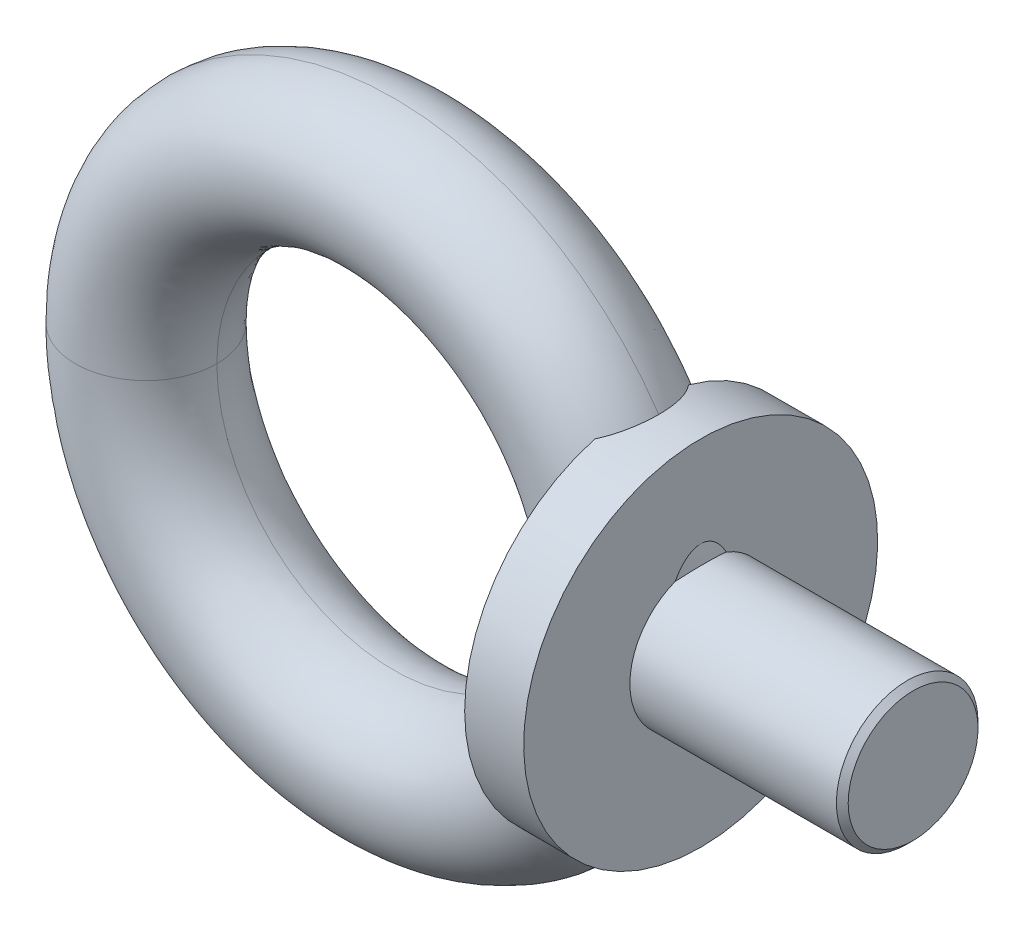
ISO-10303-21;
HEADER;
FILE_DESCRIPTION(('STEP AP214'),'2;1');
FILE_NAME('part.step','',(''),(''),'','','');
FILE_SCHEMA(('AUTOMOTIVE_DESIGN { 1 0 10303 214 1 1 1 1 }'));
ENDSEC;
DATA;
#1=APPLICATION_CONTEXT('core data for automotive mechanical design processes');
#2=APPLICATION_PROTOCOL_DEFINITION('international standard','automotive_design',2000,#1);
#3=PRODUCT_CONTEXT('',#1,'mechanical');
#4=PRODUCT('Part','Part','',(#3));
#5=PRODUCT_RELATED_PRODUCT_CATEGORY('part','',(#4));
#6=PRODUCT_DEFINITION_FORMATION('','',#4);
#7=PRODUCT_DEFINITION_CONTEXT('part definition',#1,'design');
#8=PRODUCT_DEFINITION('design','',#6,#7);
#9=PRODUCT_DEFINITION_SHAPE('','',#8);
#10=(LENGTH_UNIT() NAMED_UNIT(*) SI_UNIT(.MILLI.,.METRE.));
#11=(NAMED_UNIT(*) PLANE_ANGLE_UNIT() SI_UNIT($,.RADIAN.));
#12=(NAMED_UNIT(*) SI_UNIT($,.STERADIAN.) SOLID_ANGLE_UNIT());
#13=UNCERTAINTY_MEASURE_WITH_UNIT(LENGTH_MEASURE(1.E-05),#10,'distance_accuracy_value','');
#14=(GEOMETRIC_REPRESENTATION_CONTEXT(3) GLOBAL_UNCERTAINTY_ASSIGNED_CONTEXT((#13)) GLOBAL_UNIT_ASSIGNED_CONTEXT((#10,
#11,#12)) REPRESENTATION_CONTEXT('',''));
#15=CARTESIAN_POINT('',(0.,0.,0.));
#16=DIRECTION('',(0.,0.,1.));
#17=DIRECTION('',(1.,0.,0.));
#18=AXIS2_PLACEMENT_3D('',#15,#16,#17);
#19=CARTESIAN_POINT('',(-130.,-34.566,59.434));
#20=DIRECTION('',(1.,0.,0.));
#21=DIRECTION('',(0.,1.,0.));
#22=AXIS2_PLACEMENT_3D('',#19,#20,#21);
#23=PLANE('',#22);
#24=CARTESIAN_POINT('',(-130.,-29.,65.));
#25=DIRECTION('',(-1.,0.,0.));
#26=DIRECTION('',(0.,0.,1.));
#27=AXIS2_PLACEMENT_3D('',#24,#25,#26);
#28=CIRCLE('',#27,5.5);
#29=CARTESIAN_POINT('',(-130.,-29.,70.5));
#30=VERTEX_POINT('',#29);
#31=EDGE_CURVE('E29',#30,#30,#28,.F.);
#32=ORIENTED_EDGE('',*,*,#31,.T.);
#33=EDGE_LOOP('',(#32));
#34=FACE_BOUND('',#33,.T.);
#35=ADVANCED_FACE('F24',(#34),#23,.T.);
#36=CARTESIAN_POINT('',(-130.,-29.,65.));
#37=DIRECTION('',(-1.,0.,0.));
#38=DIRECTION('',(0.,0.,1.));
#39=AXIS2_PLACEMENT_3D('',#36,#37,#38);
#40=CONICAL_SURFACE('',#39,5.5,0.785398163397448);
#41=CARTESIAN_POINT('',(-130.5,-29.,65.));
#42=DIRECTION('',(1.,0.,0.));
#43=DIRECTION('',(0.,0.,-1.));
#44=AXIS2_PLACEMENT_3D('',#41,#42,#43);
#45=CIRCLE('',#44,6.);
#46=CARTESIAN_POINT('',(-130.5,-29.,59.));
#47=VERTEX_POINT('',#46);
#48=EDGE_CURVE('E100',#47,#47,#45,.T.);
#49=ORIENTED_EDGE('',*,*,#48,.T.);
#50=EDGE_LOOP('',(#49));
#51=FACE_BOUND('',#50,.T.);
#52=ORIENTED_EDGE('',*,*,#31,.F.);
#53=EDGE_LOOP('',(#52));
#54=FACE_BOUND('',#53,.T.);
#55=ADVANCED_FACE('F358',(#51,#54),#40,.T.);
#56=CARTESIAN_POINT('',(-148.640821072,-21.883061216,62.262132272));
#57=CARTESIAN_POINT('',(-148.493699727,-22.407286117,62.262132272));
#58=CARTESIAN_POINT('',(-148.362899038,-22.935819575,62.262132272));
#59=CARTESIAN_POINT('',(-148.248544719,-23.468153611,62.262132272));
#60=CARTESIAN_POINT('',(-147.775350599,-21.640170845,64.015028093));
#61=CARTESIAN_POINT('',(-147.623208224,-22.18228675,64.015028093));
#62=CARTESIAN_POINT('',(-147.487943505,-22.728858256,64.015028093));
#63=CARTESIAN_POINT('',(-147.369686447,-23.27936005,64.015028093));
#64=CARTESIAN_POINT('',(-147.775350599,-21.640170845,65.984971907));
#65=CARTESIAN_POINT('',(-147.623208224,-22.18228675,65.984971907));
#66=CARTESIAN_POINT('',(-147.487943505,-22.728858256,65.984971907));
#67=CARTESIAN_POINT('',(-147.369686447,-23.27936005,65.984971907));
#68=CARTESIAN_POINT('',(-148.640821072,-21.883061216,67.737867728));
#69=CARTESIAN_POINT('',(-148.493699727,-22.407286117,67.737867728));
#70=CARTESIAN_POINT('',(-148.362899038,-22.935819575,67.737867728));
#71=CARTESIAN_POINT('',(-148.248544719,-23.468153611,67.737867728));
#72=(BOUNDED_SURFACE() B_SPLINE_SURFACE(3,3,((#56,#57,#58,#59),(#60,#61,#62,#63),(#64,#65,#66,
#67),(#68,#69,#70,#71)),.UNSPECIFIED.,.F.,.F.,.F.) B_SPLINE_SURFACE_WITH_KNOTS((4,4),(4,4),(0.,
1.),(0.,1.),.UNSPECIFIED.) GEOMETRIC_REPRESENTATION_ITEM() RATIONAL_B_SPLINE_SURFACE(((1.,
0.999679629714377,0.999679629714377,1.),(0.926546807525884,0.926249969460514,0.926249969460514,
0.926546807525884),(0.926546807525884,0.926249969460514,0.926249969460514,0.926546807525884),
(1.,0.999679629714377,0.999679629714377,1.))) REPRESENTATION_ITEM('') SURFACE());
#73=CARTESIAN_POINT('',(-148.,-23.4047619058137,67.1664050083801));
#74=CARTESIAN_POINT('',(-148.,-23.3461375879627,67.1345465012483));
#75=CARTESIAN_POINT('',(-148.,-23.2880537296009,67.101703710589));
#76=CARTESIAN_POINT('',(-148.,-23.1731217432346,67.0338865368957));
#77=CARTESIAN_POINT('',(-148.,-23.1162739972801,66.998911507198));
#78=CARTESIAN_POINT('',(-148.,-22.9461304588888,66.8894539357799));
#79=CARTESIAN_POINT('',(-148.,-22.8350635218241,66.81141616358));
#80=CARTESIAN_POINT('',(-148.,-22.6558675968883,66.6716846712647));
#81=CARTESIAN_POINT('',(-148.,-22.5854867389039,66.612888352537));
#82=CARTESIAN_POINT('',(-148.,-22.4495110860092,66.4900062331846));
#83=CARTESIAN_POINT('',(-148.,-22.3839181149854,66.4259184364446));
#84=CARTESIAN_POINT('',(-148.,-22.1970067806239,66.225907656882));
#85=CARTESIAN_POINT('',(-148.000000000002,-22.0842982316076,66.0813025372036));
#86=CARTESIAN_POINT('',(-148.000000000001,-21.9387847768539,65.8385627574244));
#87=CARTESIAN_POINT('',(-148.,-21.892741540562,65.748382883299));
#88=CARTESIAN_POINT('',(-148.,-21.8347632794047,65.6085233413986));
#89=CARTESIAN_POINT('',(-148.,-21.817281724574,65.5611250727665));
#90=CARTESIAN_POINT('',(-148.,-21.7863738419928,65.4650333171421));
#91=CARTESIAN_POINT('',(-148.,-21.7729458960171,65.4163403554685));
#92=CARTESIAN_POINT('',(-148.,-21.750363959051,65.3175499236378));
#93=CARTESIAN_POINT('',(-148.,-21.7412457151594,65.2674442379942));
#94=CARTESIAN_POINT('',(-148.,-21.7276869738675,65.1666235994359));
#95=CARTESIAN_POINT('',(-148.,-21.7232443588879,65.1159089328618));
#96=CARTESIAN_POINT('',(-148.,-21.7191555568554,65.0142858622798));
#97=CARTESIAN_POINT('',(-148.,-21.7195090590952,64.9633774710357));
#98=CARTESIAN_POINT('',(-148.,-21.7249932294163,64.8618332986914));
#99=CARTESIAN_POINT('',(-148.,-21.7301237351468,64.8111975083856));
#100=CARTESIAN_POINT('',(-148.,-21.7510861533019,64.6699007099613));
#101=CARTESIAN_POINT('',(-148.,-21.7722166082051,64.5799806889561));
#102=CARTESIAN_POINT('',(-148.,-21.8280248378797,64.4045315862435));
#103=CARTESIAN_POINT('',(-148.,-21.8627111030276,64.3190052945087));
#104=CARTESIAN_POINT('',(-148.,-21.9612763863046,64.1167809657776));
#105=CARTESIAN_POINT('',(-148.,-22.031279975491,64.0030776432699));
#106=CARTESIAN_POINT('',(-148.,-22.1883800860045,63.7880971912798));
#107=CARTESIAN_POINT('',(-148.,-22.2755212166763,63.6868536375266));
#108=CARTESIAN_POINT('',(-148.,-22.4057231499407,63.5536079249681));
#109=CARTESIAN_POINT('',(-148.,-22.443796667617,63.5165645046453));
#110=CARTESIAN_POINT('',(-148.,-22.521567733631,63.4443347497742));
#111=CARTESIAN_POINT('',(-148.,-22.5612627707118,63.4091457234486));
#112=CARTESIAN_POINT('',(-148.,-22.6824982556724,63.3061862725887));
#113=CARTESIAN_POINT('',(-148.,-22.7662274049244,63.2409848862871));
#114=CARTESIAN_POINT('',(-148.,-22.9403278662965,63.1152188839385));
#115=CARTESIAN_POINT('',(-148.,-23.0308141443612,63.0548150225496));
#116=CARTESIAN_POINT('',(-148.,-23.1692115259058,62.9686419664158));
#117=CARTESIAN_POINT('',(-148.,-23.2157684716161,62.9406672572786));
#118=CARTESIAN_POINT('',(-148.,-23.3096853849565,62.8861085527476));
#119=CARTESIAN_POINT('',(-148.,-23.3570452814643,62.8595244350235));
#120=CARTESIAN_POINT('',(-148.,-23.404761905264,62.8335949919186));
#121=B_SPLINE_CURVE_WITH_KNOTS('',3,(#73,#74,#75,#76,#77,#78,#79,#80,#81,#82,#83,#84,#85,#86,
#87,#88,#89,#90,#91,#92,#93,#94,#95,#96,#97,#98,#99,#100,#101,#102,#103,#104,#105,#106,#107,
#108,#109,#110,#111,#112,#113,#114,#115,#116,#117,#118,#119,#120),.UNSPECIFIED.,.F.,.F.,(4,2,2,
2,2,2,2,2,2,2,2,2,2,2,2,2,2,2,2,2,2,2,2,4),(0.,0.200141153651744,0.400343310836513,
0.806953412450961,1.08181256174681,1.3567758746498,1.90205105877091,2.20468732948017,
2.35608753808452,2.50742722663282,2.66000108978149,2.81250582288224,2.96500067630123,
3.11749034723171,3.39327580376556,3.66923426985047,4.06756194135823,4.46694052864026,
4.62626560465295,4.78535265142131,5.10336416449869,5.42948975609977,5.59241532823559,
5.75532654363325),.UNSPECIFIED.);
#122=CARTESIAN_POINT('',(-148.000000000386,-23.4047619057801,67.1664050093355));
#123=VERTEX_POINT('',#122);
#124=CARTESIAN_POINT('',(-148.000000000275,-23.4047619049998,62.8335949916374));
#125=VERTEX_POINT('',#124);
#126=EDGE_CURVE('E96',#123,#125,#121,.T.);
#127=CARTESIAN_POINT('',(-148.000000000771,-23.4047619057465,67.166405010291));
#128=CARTESIAN_POINT('',(-147.973457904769,-23.371899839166,67.0815426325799));
#129=CARTESIAN_POINT('',(-147.948393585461,-23.3408178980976,66.995521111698));
#130=CARTESIAN_POINT('',(-147.901332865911,-23.2823841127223,66.8213450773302));
#131=CARTESIAN_POINT('',(-147.879338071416,-23.2550342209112,66.7331894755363));
#132=CARTESIAN_POINT('',(-147.838553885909,-23.2042655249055,66.5550072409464));
#133=CARTESIAN_POINT('',(-147.819764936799,-23.180847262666,66.464980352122));
#134=CARTESIAN_POINT('',(-147.785533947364,-23.1381443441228,66.2834815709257));
#135=CARTESIAN_POINT('',(-147.770086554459,-23.1188530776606,66.1920122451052));
#136=CARTESIAN_POINT('',(-147.742597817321,-23.0845004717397,66.0077905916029));
#137=CARTESIAN_POINT('',(-147.730555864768,-23.06943837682,65.9150384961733));
#138=CARTESIAN_POINT('',(-147.709951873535,-23.0436541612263,65.7285645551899));
#139=CARTESIAN_POINT('',(-147.701389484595,-23.0329316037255,65.6348428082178));
#140=CARTESIAN_POINT('',(-147.684638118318,-23.0119484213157,65.4029565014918));
#141=CARTESIAN_POINT('',(-147.678476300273,-23.004223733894,65.2644018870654));
#142=CARTESIAN_POINT('',(-147.673837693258,-22.9984091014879,64.9869566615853));
#143=CARTESIAN_POINT('',(-147.675361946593,-23.0003204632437,64.8480660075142));
#144=CARTESIAN_POINT('',(-147.68607181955,-23.0137431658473,64.5711333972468));
#145=CARTESIAN_POINT('',(-147.695252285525,-23.0252480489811,64.4330909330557));
#146=CARTESIAN_POINT('',(-147.72112787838,-23.0576439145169,64.1588834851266));
#147=CARTESIAN_POINT('',(-147.737821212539,-23.0785326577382,64.0227180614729));
#148=CARTESIAN_POINT('',(-147.785697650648,-23.1383600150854,63.7055652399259));
#149=CARTESIAN_POINT('',(-147.819915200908,-23.1810669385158,63.52571738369));
#150=CARTESIAN_POINT('',(-147.880608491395,-23.256614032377,63.2616325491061));
#151=CARTESIAN_POINT('',(-147.902391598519,-23.2836994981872,63.1745812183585));
#152=CARTESIAN_POINT('',(-147.948967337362,-23.3415294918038,63.0025161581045));
#153=CARTESIAN_POINT('',(-147.973760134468,-23.3722742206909,62.9175025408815));
#154=CARTESIAN_POINT('',(-148.000000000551,-23.4047619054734,62.8335949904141));
#155=B_SPLINE_CURVE_WITH_KNOTS('',3,(#127,#128,#129,#130,#131,#132,#133,#134,#135,#136,#137,
#138,#139,#140,#141,#142,#143,#144,#145,#146,#147,#148,#149,#150,#151,#152,#153,#154),
.UNSPECIFIED.,.F.,.F.,(4,2,2,2,2,2,2,2,2,2,2,2,2,4),(0.,0.284358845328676,0.56886589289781,
0.853412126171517,1.13749913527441,1.42153536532,1.70554299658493,2.12168639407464,
2.53788622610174,2.9538061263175,3.36962683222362,3.93218572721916,4.21327082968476,
4.49437138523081),.UNSPECIFIED.);
#156=EDGE_CURVE('E91',#123,#125,#155,.T.);
#157=ORIENTED_EDGE('',*,*,#126,.F.);
#158=ORIENTED_EDGE('',*,*,#156,.T.);
#159=EDGE_LOOP('',(#157,#158));
#160=FACE_BOUND('',#159,.T.);
#161=ADVANCED_FACE('F99',(#160),#72,.T.);
#162=CARTESIAN_POINT('',(-148.248544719,-34.531846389,62.262132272));
#163=CARTESIAN_POINT('',(-148.362899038,-35.064180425,62.262132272));
#164=CARTESIAN_POINT('',(-148.493699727,-35.592713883,62.262132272));
#165=CARTESIAN_POINT('',(-148.640821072,-36.116938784,62.262132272));
#166=CARTESIAN_POINT('',(-147.369686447,-34.72063995,64.015028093));
#167=CARTESIAN_POINT('',(-147.487943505,-35.271141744,64.015028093));
#168=CARTESIAN_POINT('',(-147.623208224,-35.81771325,64.015028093));
#169=CARTESIAN_POINT('',(-147.775350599,-36.359829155,64.015028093));
#170=CARTESIAN_POINT('',(-147.369686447,-34.72063995,65.984971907));
#171=CARTESIAN_POINT('',(-147.487943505,-35.271141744,65.984971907));
#172=CARTESIAN_POINT('',(-147.623208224,-35.81771325,65.984971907));
#173=CARTESIAN_POINT('',(-147.775350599,-36.359829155,65.984971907));
#174=CARTESIAN_POINT('',(-148.248544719,-34.531846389,67.737867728));
#175=CARTESIAN_POINT('',(-148.362899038,-35.064180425,67.737867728));
#176=CARTESIAN_POINT('',(-148.493699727,-35.592713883,67.737867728));
#177=CARTESIAN_POINT('',(-148.640821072,-36.116938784,67.737867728));
#178=(BOUNDED_SURFACE() B_SPLINE_SURFACE(3,3,((#162,#163,#164,#165),(#166,#167,#168,#169),(#170,
#171,#172,#173),(#174,#175,#176,#177)),.UNSPECIFIED.,.F.,.F.,
.F.) B_SPLINE_SURFACE_WITH_KNOTS((4,4),(4,4),(0.,1.),(0.,1.),
.UNSPECIFIED.) GEOMETRIC_REPRESENTATION_ITEM() RATIONAL_B_SPLINE_SURFACE(((1.,0.999679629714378,
0.999679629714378,1.),(0.926546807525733,0.926249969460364,0.926249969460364,0.926546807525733),
(0.926546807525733,0.926249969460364,0.926249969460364,0.926546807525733),(1.,0.999679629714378,
0.999679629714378,1.))) REPRESENTATION_ITEM('') SURFACE());
#179=CARTESIAN_POINT('',(-148.,-34.5952380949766,62.8335949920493));
#180=CARTESIAN_POINT('',(-148.,-34.6538624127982,62.8654534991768));
#181=CARTESIAN_POINT('',(-148.,-34.7119462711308,62.8982962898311));
#182=CARTESIAN_POINT('',(-148.,-34.826878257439,62.9661134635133));
#183=CARTESIAN_POINT('',(-148.,-34.8837260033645,63.0010884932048));
#184=CARTESIAN_POINT('',(-148.,-35.0538695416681,63.110546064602));
#185=CARTESIAN_POINT('',(-148.,-35.1649364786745,63.1885838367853));
#186=CARTESIAN_POINT('',(-148.,-35.3441324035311,63.3283153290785));
#187=CARTESIAN_POINT('',(-148.,-35.4145132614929,63.3871116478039));
#188=CARTESIAN_POINT('',(-148.,-35.5504889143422,63.5099937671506));
#189=CARTESIAN_POINT('',(-148.,-35.6160818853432,63.5740815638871));
#190=CARTESIAN_POINT('',(-148.,-35.8029932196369,63.7740923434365));
#191=CARTESIAN_POINT('',(-148.000000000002,-35.9157017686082,63.9186974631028));
#192=CARTESIAN_POINT('',(-148.000000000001,-36.0612152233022,64.1614372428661));
#193=CARTESIAN_POINT('',(-148.,-36.1072584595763,64.2516171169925));
#194=CARTESIAN_POINT('',(-148.,-36.1652367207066,64.3914766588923));
#195=CARTESIAN_POINT('',(-148.,-36.1827182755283,64.4388749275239));
#196=CARTESIAN_POINT('',(-148.,-36.2136261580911,64.5349666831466));
#197=CARTESIAN_POINT('',(-148.,-36.2270541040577,64.583659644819));
#198=CARTESIAN_POINT('',(-148.,-36.249636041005,64.6824500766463));
#199=CARTESIAN_POINT('',(-148.,-36.2587542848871,64.7325557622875));
#200=CARTESIAN_POINT('',(-148.,-36.2723130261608,64.8333764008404));
#201=CARTESIAN_POINT('',(-148.,-36.2767556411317,64.8840910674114));
#202=CARTESIAN_POINT('',(-148.,-36.2808444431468,64.9857141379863));
#203=CARTESIAN_POINT('',(-148.,-36.2804909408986,65.0366225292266));
#204=CARTESIAN_POINT('',(-148.,-36.2750067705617,65.1381667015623));
#205=CARTESIAN_POINT('',(-148.,-36.269876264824,65.1888024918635));
#206=CARTESIAN_POINT('',(-148.,-36.2489138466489,65.3300992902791));
#207=CARTESIAN_POINT('',(-148.,-36.227783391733,65.4200193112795));
#208=CARTESIAN_POINT('',(-148.,-36.1719751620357,65.5954684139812));
#209=CARTESIAN_POINT('',(-148.,-36.1372888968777,65.6809947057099));
#210=CARTESIAN_POINT('',(-148.,-36.0387236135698,65.8832190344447));
#211=CARTESIAN_POINT('',(-148.,-35.9687200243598,65.9969223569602));
#212=CARTESIAN_POINT('',(-148.,-35.811619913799,66.2119028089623));
#213=CARTESIAN_POINT('',(-148.,-35.7244787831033,66.3131463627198));
#214=CARTESIAN_POINT('',(-148.,-35.5942768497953,66.4463920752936));
#215=CARTESIAN_POINT('',(-148.,-35.5562033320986,66.4834354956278));
#216=CARTESIAN_POINT('',(-148.,-35.4784322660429,66.55566525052));
#217=CARTESIAN_POINT('',(-148.,-35.4387372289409,66.5908542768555));
#218=CARTESIAN_POINT('',(-148.,-35.3175017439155,66.6938137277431));
#219=CARTESIAN_POINT('',(-148.,-35.2337725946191,66.759015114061));
#220=CARTESIAN_POINT('',(-148.,-35.059672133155,66.8847811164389));
#221=CARTESIAN_POINT('',(-148.,-34.9691858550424,66.9451849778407));
#222=CARTESIAN_POINT('',(-148.,-34.8307884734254,67.0313580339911));
#223=CARTESIAN_POINT('',(-148.,-34.784231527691,67.0593327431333));
#224=CARTESIAN_POINT('',(-148.,-34.6903146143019,67.1138914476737));
#225=CARTESIAN_POINT('',(-148.,-34.6429547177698,67.140475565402));
#226=CARTESIAN_POINT('',(-148.,-34.5952380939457,67.1664050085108));
#227=B_SPLINE_CURVE_WITH_KNOTS('',3,(#179,#180,#181,#182,#183,#184,#185,#186,#187,#188,#189,
#190,#191,#192,#193,#194,#195,#196,#197,#198,#199,#200,#201,#202,#203,#204,#205,#206,#207,#208,
#209,#210,#211,#212,#213,#214,#215,#216,#217,#218,#219,#220,#221,#222,#223,#224,#225,#226),
.UNSPECIFIED.,.F.,.F.,(4,2,2,2,2,2,2,2,2,2,2,2,2,2,2,2,2,2,2,2,2,2,2,4),(0.,0.200141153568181,
0.400343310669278,0.80695341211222,1.08181256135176,1.35677587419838,1.90205105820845,
2.20468732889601,2.35608753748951,2.5074272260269,2.66000108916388,2.81250582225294,
2.96500067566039,3.11749034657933,3.393275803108,3.66923426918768,4.06756194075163,
4.46694052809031,4.62626560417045,4.78535265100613,5.1033641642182,5.42948975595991,
5.59241532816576,5.75532654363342),.UNSPECIFIED.);
#228=CARTESIAN_POINT('',(-148.000000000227,-34.5952380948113,62.833594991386));
#229=VERTEX_POINT('',#228);
#230=CARTESIAN_POINT('',(-148.000000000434,-34.5952380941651,67.1664050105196));
#231=VERTEX_POINT('',#230);
#232=EDGE_CURVE('E95',#229,#231,#227,.T.);
#233=CARTESIAN_POINT('',(-148.000000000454,-34.5952380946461,62.8335949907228));
#234=CARTESIAN_POINT('',(-147.973457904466,-34.6281001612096,62.9184573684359));
#235=CARTESIAN_POINT('',(-147.948393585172,-34.659182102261,63.0044788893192));
#236=CARTESIAN_POINT('',(-147.90133286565,-34.7176158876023,63.1786549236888));
#237=CARTESIAN_POINT('',(-147.879338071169,-34.7449657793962,63.2668105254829));
#238=CARTESIAN_POINT('',(-147.838553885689,-34.7957344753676,63.4449927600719));
#239=CARTESIAN_POINT('',(-147.819764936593,-34.81915273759,63.5350196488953));
#240=CARTESIAN_POINT('',(-147.785533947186,-34.861855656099,63.7165184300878));
#241=CARTESIAN_POINT('',(-147.770086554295,-34.8811469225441,63.8079877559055));
#242=CARTESIAN_POINT('',(-147.742597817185,-34.9154995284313,63.992209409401));
#243=CARTESIAN_POINT('',(-147.730555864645,-34.9305616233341,64.0849615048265));
#244=CARTESIAN_POINT('',(-147.709951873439,-34.9563458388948,64.2714354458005));
#245=CARTESIAN_POINT('',(-147.701389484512,-34.9670683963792,64.3651571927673));
#246=CARTESIAN_POINT('',(-147.684638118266,-34.9880515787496,64.5970434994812));
#247=CARTESIAN_POINT('',(-147.678476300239,-34.9957762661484,64.7355981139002));
#248=CARTESIAN_POINT('',(-147.67383769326,-35.0015908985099,65.0130433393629));
#249=CARTESIAN_POINT('',(-147.675361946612,-34.9996795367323,65.1519339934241));
#250=CARTESIAN_POINT('',(-147.686071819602,-34.9862568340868,65.4288666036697));
#251=CARTESIAN_POINT('',(-147.695252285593,-34.9747519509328,65.5669090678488));
#252=CARTESIAN_POINT('',(-147.72112787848,-34.9423560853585,65.8411165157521));
#253=CARTESIAN_POINT('',(-147.737821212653,-34.9214673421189,65.977281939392));
#254=CARTESIAN_POINT('',(-147.785697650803,-34.8616399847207,66.2944347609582));
#255=CARTESIAN_POINT('',(-147.819915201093,-34.8189330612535,66.4742826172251));
#256=CARTESIAN_POINT('',(-147.880608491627,-34.7433859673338,66.7383674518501));
#257=CARTESIAN_POINT('',(-147.902391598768,-34.7163005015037,66.8254187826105));
#258=CARTESIAN_POINT('',(-147.948967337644,-34.658470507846,66.9974838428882));
#259=CARTESIAN_POINT('',(-147.973760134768,-34.627725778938,67.0824974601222));
#260=CARTESIAN_POINT('',(-148.000000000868,-34.595238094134,67.1664050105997));
#261=B_SPLINE_CURVE_WITH_KNOTS('',3,(#233,#234,#235,#236,#237,#238,#239,#240,#241,#242,#243,
#244,#245,#246,#247,#248,#249,#250,#251,#252,#253,#254,#255,#256,#257,#258,#259,#260),
.UNSPECIFIED.,.F.,.F.,(4,2,2,2,2,2,2,2,2,2,2,2,2,4),(0.,0.284358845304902,0.568865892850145,
0.853412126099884,1.13749913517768,1.42153536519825,1.70554299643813,2.12168639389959,
2.53788622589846,2.953806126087,3.36962683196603,3.9321857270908,4.21327082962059,
4.4943713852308),.UNSPECIFIED.);
#262=EDGE_CURVE('E93',#229,#231,#261,.T.);
#263=ORIENTED_EDGE('',*,*,#232,.F.);
#264=ORIENTED_EDGE('',*,*,#262,.T.);
#265=EDGE_LOOP('',(#263,#264));
#266=FACE_BOUND('',#265,.T.);
#267=ADVANCED_FACE('F131',(#266),#178,.T.);
#268=CARTESIAN_POINT('',(-148.,-29.,65.));
#269=DIRECTION('',(1.,0.,0.));
#270=DIRECTION('',(0.,1.,0.));
#271=AXIS2_PLACEMENT_3D('',#268,#269,#270);
#272=CYLINDRICAL_SURFACE('',#271,6.);
#273=CARTESIAN_POINT('',(-148.,-29.,65.));
#274=DIRECTION('',(1.,0.,0.));
#275=DIRECTION('',(0.,1.,0.));
#276=AXIS2_PLACEMENT_3D('',#273,#274,#275);
#277=CIRCLE('',#276,6.);
#278=EDGE_CURVE('E87',#125,#229,#277,.F.);
#279=ORIENTED_EDGE('',*,*,#278,.F.);
#280=ORIENTED_EDGE('',*,*,#156,.F.);
#281=CARTESIAN_POINT('',(-148.,-29.,65.));
#282=DIRECTION('',(1.,0.,0.));
#283=DIRECTION('',(0.,1.,0.));
#284=AXIS2_PLACEMENT_3D('',#281,#282,#283);
#285=CIRCLE('',#284,6.);
#286=EDGE_CURVE('E82',#231,#123,#285,.F.);
#287=ORIENTED_EDGE('',*,*,#286,.F.);
#288=ORIENTED_EDGE('',*,*,#262,.F.);
#289=EDGE_LOOP('',(#279,#280,#287,#288));
#290=FACE_BOUND('',#289,.T.);
#291=ORIENTED_EDGE('',*,*,#48,.F.);
#292=EDGE_LOOP('',(#291));
#293=FACE_BOUND('',#292,.T.);
#294=ADVANCED_FACE('F89',(#290,#293),#272,.T.);
#295=CARTESIAN_POINT('',(-148.,-44.18,49.82));
#296=DIRECTION('',(1.,0.,0.));
#297=DIRECTION('',(0.,1.,0.));
#298=AXIS2_PLACEMENT_3D('',#295,#296,#297);
#299=PLANE('',#298);
#300=ORIENTED_EDGE('',*,*,#232,.T.);
#301=ORIENTED_EDGE('',*,*,#286,.T.);
#302=ORIENTED_EDGE('',*,*,#126,.T.);
#303=ORIENTED_EDGE('',*,*,#278,.T.);
#304=EDGE_LOOP('',(#300,#301,#302,#303));
#305=FACE_BOUND('',#304,.T.);
#306=CARTESIAN_POINT('',(-148.,-29.,65.));
#307=DIRECTION('',(-1.,0.,0.));
#308=DIRECTION('',(0.,-1.,0.));
#309=AXIS2_PLACEMENT_3D('',#306,#307,#308);
#310=CIRCLE('',#309,15.);
#311=CARTESIAN_POINT('',(-148.,-44.,65.));
#312=VERTEX_POINT('',#311);
#313=EDGE_CURVE('E182',#312,#312,#310,.F.);
#314=ORIENTED_EDGE('',*,*,#313,.T.);
#315=EDGE_LOOP('',(#314));
#316=FACE_BOUND('',#315,.T.);
#317=ADVANCED_FACE('F101',(#305,#316),#299,.T.);
#318=CARTESIAN_POINT('',(-153.,-14.360938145,68.902438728));
#319=DIRECTION('',(-1.,0.,0.));
#320=DIRECTION('',(0.,-1.,0.));
#321=AXIS2_PLACEMENT_3D('',#318,#319,#320);
#322=PLANE('',#321);
#323=CARTESIAN_POINT('',(-153.,-29.,65.));
#324=DIRECTION('',(-1.,0.,0.));
#325=DIRECTION('',(0.,-1.,0.));
#326=AXIS2_PLACEMENT_3D('',#323,#324,#325);
#327=CIRCLE('',#326,15.);
#328=CARTESIAN_POINT('',(-153.,-43.4654761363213,68.9686269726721));
#329=VERTEX_POINT('',#328);
#330=CARTESIAN_POINT('',(-153.,-14.5345238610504,68.9686269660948));
#331=VERTEX_POINT('',#330);
#332=EDGE_CURVE('E179',#329,#331,#327,.T.);
#333=ORIENTED_EDGE('',*,*,#332,.T.);
#334=CARTESIAN_POINT('',(-153.,-29.,71.));
#335=CARTESIAN_POINT('',(-153.,-28.8317940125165,70.9999968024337));
#336=CARTESIAN_POINT('',(-153.,-28.6635880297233,71.0000004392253));
#337=CARTESIAN_POINT('',(-153.,-28.3271760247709,70.9999934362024));
#338=CARTESIAN_POINT('',(-153.,-28.1589700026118,70.9999827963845));
#339=CARTESIAN_POINT('',(-153.,-27.6503931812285,70.999886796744));
#340=CARTESIAN_POINT('',(-153.,-27.3100223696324,70.9997361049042));
#341=CARTESIAN_POINT('',(-153.,-26.6262427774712,70.998660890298));
#342=CARTESIAN_POINT('',(-153.,-26.2828340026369,70.9977294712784));
#343=CARTESIAN_POINT('',(-153.,-25.5939021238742,70.9940531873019));
#344=CARTESIAN_POINT('',(-153.,-25.2483790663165,70.9912971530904));
#345=CARTESIAN_POINT('',(-153.,-24.5561445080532,70.9825301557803));
#346=CARTESIAN_POINT('',(-153.,-24.2094331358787,70.9765076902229));
#347=CARTESIAN_POINT('',(-153.,-23.5157482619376,70.959404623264));
#348=CARTESIAN_POINT('',(-153.,-23.1687748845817,70.9483185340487));
#349=CARTESIAN_POINT('',(-153.,-22.4923541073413,70.919685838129));
#350=CARTESIAN_POINT('',(-153.,-22.1628926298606,70.902487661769));
#351=CARTESIAN_POINT('',(-153.,-21.505222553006,70.8595414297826));
#352=CARTESIAN_POINT('',(-153.,-21.1770127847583,70.8338119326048));
#353=CARTESIAN_POINT('',(-153.,-20.5226334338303,70.7715325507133));
#354=CARTESIAN_POINT('',(-153.,-20.1964606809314,70.7350168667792));
#355=CARTESIAN_POINT('',(-153.,-19.5469676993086,70.6486555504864));
#356=CARTESIAN_POINT('',(-153.,-19.2236415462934,70.5988555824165));
#357=CARTESIAN_POINT('',(-153.,-18.5807151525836,70.4831109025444));
#358=CARTESIAN_POINT('',(-153.,-18.2611074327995,70.4172083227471));
#359=CARTESIAN_POINT('',(-153.,-17.6264587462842,70.2659521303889));
#360=CARTESIAN_POINT('',(-153.,-17.3114168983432,70.1806023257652));
#361=CARTESIAN_POINT('',(-153.,-16.8926722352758,70.0503654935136));
#362=CARTESIAN_POINT('',(-153.,-16.7857750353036,70.0156180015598));
#363=CARTESIAN_POINT('',(-153.,-16.5729054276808,69.9432036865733));
#364=CARTESIAN_POINT('',(-153.,-16.4669335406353,69.9055353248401));
#365=CARTESIAN_POINT('',(-153.,-16.256115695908,69.8271302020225));
#366=CARTESIAN_POINT('',(-153.,-16.1512698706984,69.7863930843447));
#367=CARTESIAN_POINT('',(-153.,-15.9429033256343,69.7016919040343));
#368=CARTESIAN_POINT('',(-153.,-15.8393824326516,69.6577282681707));
#369=CARTESIAN_POINT('',(-153.,-15.6327453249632,69.5659080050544));
#370=CARTESIAN_POINT('',(-153.,-15.5296454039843,69.5180146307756));
#371=CARTESIAN_POINT('',(-153.,-15.3252159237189,69.4185713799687));
#372=CARTESIAN_POINT('',(-153.,-15.2238864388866,69.367021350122));
#373=CARTESIAN_POINT('',(-153.,-15.0232143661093,69.2600602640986));
#374=CARTESIAN_POINT('',(-153.,-14.9238728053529,69.2046472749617));
#375=CARTESIAN_POINT('',(-153.,-14.7274155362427,69.0897352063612));
#376=CARTESIAN_POINT('',(-153.,-14.63030280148,69.0302310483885));
#377=CARTESIAN_POINT('',(-153.,-14.5345238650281,68.9686269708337));
#378=B_SPLINE_CURVE_WITH_KNOTS('',3,(#334,#335,#336,#337,#338,#339,#340,#341,#342,#343,#344,
#345,#346,#347,#348,#349,#350,#351,#352,#353,#354,#355,#356,#357,#358,#359,#360,#361,#362,#363,
#364,#365,#366,#367,#368,#369,#370,#371,#372,#373,#374,#375,#376,#377),.UNSPECIFIED.,.F.,.F.,(4,
2,2,2,2,2,2,2,2,2,2,2,2,2,2,2,2,2,2,2,2,4),(0.,0.504617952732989,1.00923602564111,
2.0303484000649,3.06057660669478,4.09717032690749,5.13743825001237,6.17883627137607,
7.16848245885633,8.155989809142,9.14039898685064,10.1214669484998,11.0999949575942,
12.078331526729,12.4155087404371,12.752864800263,13.0902601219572,13.4276108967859,
13.7685856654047,14.1095747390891,14.4507356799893,14.7923280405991),.UNSPECIFIED.);
#379=CARTESIAN_POINT('',(-153.,-29.,71.));
#380=VERTEX_POINT('',#379);
#381=EDGE_CURVE('E172',#380,#331,#378,.T.);
#382=ORIENTED_EDGE('',*,*,#381,.F.);
#383=CARTESIAN_POINT('',(-153.,-43.4654761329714,68.9686269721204));
#384=CARTESIAN_POINT('',(-153.,-43.3577027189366,69.0379440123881));
#385=CARTESIAN_POINT('',(-153.,-43.2482454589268,69.1046017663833));
#386=CARTESIAN_POINT('',(-153.,-43.026607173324,69.2327300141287));
#387=CARTESIAN_POINT('',(-153.,-42.9144316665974,69.2942100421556));
#388=CARTESIAN_POINT('',(-153.,-42.6876817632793,69.4123263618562));
#389=CARTESIAN_POINT('',(-153.,-42.5731093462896,69.4689664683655));
#390=CARTESIAN_POINT('',(-153.,-42.3418506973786,69.5777063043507));
#391=CARTESIAN_POINT('',(-153.,-42.2251647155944,69.6298065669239));
#392=CARTESIAN_POINT('',(-153.,-41.9913079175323,69.7291620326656));
#393=CARTESIAN_POINT('',(-153.,-41.8741574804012,69.7764653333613));
#394=CARTESIAN_POINT('',(-153.,-41.6383130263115,69.8671389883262));
#395=CARTESIAN_POINT('',(-153.,-41.5196186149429,69.9105083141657));
#396=CARTESIAN_POINT('',(-153.,-41.2809385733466,69.9935346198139));
#397=CARTESIAN_POINT('',(-153.,-41.1609529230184,70.0331915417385));
#398=CARTESIAN_POINT('',(-153.,-40.9199432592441,70.1089988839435));
#399=CARTESIAN_POINT('',(-153.,-40.7989197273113,70.1451508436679));
#400=CARTESIAN_POINT('',(-153.,-40.3716537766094,70.2665570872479));
#401=CARTESIAN_POINT('',(-153.,-40.0629124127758,70.3431141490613));
#402=CARTESIAN_POINT('',(-153.,-39.4416938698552,70.4787688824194));
#403=CARTESIAN_POINT('',(-153.,-39.1292163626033,70.5378650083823));
#404=CARTESIAN_POINT('',(-153.,-38.5012255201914,70.6416053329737));
#405=CARTESIAN_POINT('',(-153.,-38.1857071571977,70.6862186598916));
#406=CARTESIAN_POINT('',(-153.,-37.5523469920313,70.7635367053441));
#407=CARTESIAN_POINT('',(-153.,-37.2345011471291,70.7962074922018));
#408=CARTESIAN_POINT('',(-153.,-36.5971480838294,70.8518908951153));
#409=CARTESIAN_POINT('',(-153.,-36.2776386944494,70.8748779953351));
#410=CARTESIAN_POINT('',(-153.,-35.6376002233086,70.9132207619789));
#411=CARTESIAN_POINT('',(-153.,-35.3170703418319,70.9285625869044));
#412=CARTESIAN_POINT('',(-153.,-34.6603857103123,70.9540369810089));
#413=CARTESIAN_POINT('',(-153.,-34.3242203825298,70.9638837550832));
#414=CARTESIAN_POINT('',(-153.,-33.6521011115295,70.9790807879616));
#415=CARTESIAN_POINT('',(-153.,-33.3161472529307,70.9844351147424));
#416=CARTESIAN_POINT('',(-153.,-32.6452000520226,70.9922357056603));
#417=CARTESIAN_POINT('',(-153.,-32.3102067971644,70.9946904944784));
#418=CARTESIAN_POINT('',(-153.,-31.6419296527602,70.9979690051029));
#419=CARTESIAN_POINT('',(-153.,-31.3086457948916,70.9988010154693));
#420=CARTESIAN_POINT('',(-153.,-30.6445344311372,70.9997630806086));
#421=CARTESIAN_POINT('',(-153.,-30.3137069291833,70.9998982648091));
#422=CARTESIAN_POINT('',(-153.,-29.8190661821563,70.9999845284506));
#423=CARTESIAN_POINT('',(-153.,-29.6552529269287,70.9999940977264));
#424=CARTESIAN_POINT('',(-153.,-29.327626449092,71.0000003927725));
#425=CARTESIAN_POINT('',(-153.,-29.163813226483,70.9999971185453));
#426=CARTESIAN_POINT('',(-153.,-29.,71.));
#427=B_SPLINE_CURVE_WITH_KNOTS('',3,(#383,#384,#385,#386,#387,#388,#389,#390,#391,#392,#393,
#394,#395,#396,#397,#398,#399,#400,#401,#402,#403,#404,#405,#406,#407,#408,#409,#410,#411,#412,
#413,#414,#415,#416,#417,#418,#419,#420,#421,#422,#423,#424,#425,#426),.UNSPECIFIED.,.F.,.F.,(4,
2,2,2,2,2,2,2,2,2,2,2,2,2,2,2,2,2,2,2,2,4),(0.,0.384350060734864,0.76797615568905,
1.1512970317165,1.53457283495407,1.91351751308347,2.29256097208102,2.67161034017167,
3.05049246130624,4.00407208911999,4.95773609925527,5.91341980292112,6.87179811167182,
7.83268611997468,8.79530751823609,9.80419282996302,10.8121635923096,11.8171634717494,
12.8170165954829,13.8094990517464,14.3009388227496,14.7923784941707),.UNSPECIFIED.);
#428=EDGE_CURVE('E194',#329,#380,#427,.T.);
#429=ORIENTED_EDGE('',*,*,#428,.F.);
#430=EDGE_LOOP('',(#333,#382,#429));
#431=FACE_BOUND('',#430,.T.);
#432=ADVANCED_FACE('F123',(#431),#322,.T.);
#433=CARTESIAN_POINT('',(-200.970024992,-29.,64.4009995));
#434=CARTESIAN_POINT('',(-200.970024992,24.940049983,64.4009995));
#435=CARTESIAN_POINT('',(-147.029975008,24.940049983,64.4009995));
#436=CARTESIAN_POINT('',(-147.029975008,-29.,64.4009995));
#437=CARTESIAN_POINT('',(-201.349394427,-29.,68.182039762));
#438=CARTESIAN_POINT('',(-201.349394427,25.698788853,68.182039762));
#439=CARTESIAN_POINT('',(-146.650605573,25.698788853,68.182039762));
#440=CARTESIAN_POINT('',(-146.650605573,-29.,68.182039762));
#441=CARTESIAN_POINT('',(-198.800024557,-29.,71.));
#442=CARTESIAN_POINT('',(-198.800024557,20.600049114,71.));
#443=CARTESIAN_POINT('',(-149.199975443,20.600049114,71.));
#444=CARTESIAN_POINT('',(-149.199975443,-29.,71.));
#445=CARTESIAN_POINT('',(-195.,-29.,71.));
#446=CARTESIAN_POINT('',(-195.,13.,71.));
#447=CARTESIAN_POINT('',(-153.,13.,71.));
#448=CARTESIAN_POINT('',(-153.,-29.,71.));
#449=CARTESIAN_POINT('',(-191.199975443,-29.,71.));
#450=CARTESIAN_POINT('',(-191.199975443,5.399950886,71.));
#451=CARTESIAN_POINT('',(-156.800024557,5.399950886,71.));
#452=CARTESIAN_POINT('',(-156.800024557,-29.,71.));
#453=CARTESIAN_POINT('',(-188.650605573,-29.,68.182039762));
#454=CARTESIAN_POINT('',(-188.650605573,0.301211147,68.182039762));
#455=CARTESIAN_POINT('',(-159.349394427,0.301211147,68.182039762));
#456=CARTESIAN_POINT('',(-159.349394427,-29.,68.182039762));
#457=CARTESIAN_POINT('',(-189.029975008,-29.,64.4009995));
#458=CARTESIAN_POINT('',(-189.029975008,1.059950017,64.4009995));
#459=CARTESIAN_POINT('',(-158.970024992,1.059950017,64.4009995));
#460=CARTESIAN_POINT('',(-158.970024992,-29.,64.4009995));
#461=(BOUNDED_SURFACE() B_SPLINE_SURFACE(3,3,((#433,#434,#435,#436),(#437,#438,#439,#440),(#441,
#442,#443,#444),(#445,#446,#447,#448),(#449,#450,#451,#452),(#453,#454,#455,#456),(#457,#458,
#459,#460)),.UNSPECIFIED.,.F.,.F.,.F.) B_SPLINE_SURFACE_WITH_KNOTS((4,3,4),(4,4),(0.,0.5,1.),
(0.,1.),.UNSPECIFIED.) GEOMETRIC_REPRESENTATION_ITEM() RATIONAL_B_SPLINE_SURFACE(((1.,
0.333333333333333,0.333333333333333,1.),(0.780588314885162,0.260196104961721,0.260196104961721,
0.780588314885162),(0.780588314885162,0.260196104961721,0.260196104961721,0.780588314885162),
(1.,0.333333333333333,0.333333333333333,1.),(0.780588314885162,0.260196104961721,
0.260196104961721,0.780588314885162),(0.780588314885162,0.260196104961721,0.260196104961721,
0.780588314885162),(1.,0.333333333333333,0.333333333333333,1.))) REPRESENTATION_ITEM('') SURFACE());
#462=CARTESIAN_POINT('',(-152.999999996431,-14.5345238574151,68.9686269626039));
#463=CARTESIAN_POINT('',(-152.894166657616,-14.5015980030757,68.848663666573));
#464=CARTESIAN_POINT('',(-152.7935821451,-14.4690116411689,68.7239919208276));
#465=CARTESIAN_POINT('',(-152.603393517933,-14.4053769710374,68.466193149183));
#466=CARTESIAN_POINT('',(-152.513787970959,-14.3743284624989,68.3330672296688));
#467=CARTESIAN_POINT('',(-152.34596296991,-14.3146020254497,68.0592096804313));
#468=CARTESIAN_POINT('',(-152.267750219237,-14.2859254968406,67.9184736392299));
#469=CARTESIAN_POINT('',(-152.123107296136,-14.2317252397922,67.6304976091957));
#470=CARTESIAN_POINT('',(-152.056676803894,-14.206201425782,67.4832577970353));
#471=CARTESIAN_POINT('',(-151.935840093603,-14.1589681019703,67.1833065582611));
#472=CARTESIAN_POINT('',(-151.881435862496,-14.1372592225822,67.0305942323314));
#473=CARTESIAN_POINT('',(-151.784848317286,-14.0982151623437,66.7208074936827));
#474=CARTESIAN_POINT('',(-151.74266503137,-14.0808799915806,66.5637330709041));
#475=CARTESIAN_POINT('',(-151.670720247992,-14.051047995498,66.2466537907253));
#476=CARTESIAN_POINT('',(-151.640934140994,-14.0385415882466,66.0866554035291));
#477=CARTESIAN_POINT('',(-151.593757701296,-14.0186317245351,65.7645955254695));
#478=CARTESIAN_POINT('',(-151.576360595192,-14.01122547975,65.6025352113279));
#479=CARTESIAN_POINT('',(-151.560131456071,-14.0043051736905,65.3667669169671));
#480=CARTESIAN_POINT('',(-151.556350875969,-14.0026906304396,65.2934272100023));
#481=CARTESIAN_POINT('',(-151.55131465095,-14.0005384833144,65.1467277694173));
#482=CARTESIAN_POINT('',(-151.550056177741,-13.9999996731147,65.0733681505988));
#483=CARTESIAN_POINT('',(-151.550055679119,-14.,64.9999999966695));
#484=B_SPLINE_CURVE_WITH_KNOTS('',3,(#462,#463,#464,#465,#466,#467,#468,#469,#470,#471,#472,
#473,#474,#475,#476,#477,#478,#479,#480,#481,#482,#483),.UNSPECIFIED.,.F.,.F.,(4,2,2,2,2,2,2,2,
2,2,4),(0.,0.48981734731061,0.979570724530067,1.4696111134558,1.95963819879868,2.44974618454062,
2.93985530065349,3.42898681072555,3.91785069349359,4.1381725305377,4.35824715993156),.UNSPECIFIED.);
#485=CARTESIAN_POINT('',(-151.550055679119,-14.,64.9999999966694));
#486=VERTEX_POINT('',#485);
#487=EDGE_CURVE('E167',#331,#486,#484,.T.);
#488=CARTESIAN_POINT('',(-174.,-29.,64.9999999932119));
#489=DIRECTION('',(0.,0.,-1.));
#490=DIRECTION('',(0.,1.,0.));
#491=AXIS2_PLACEMENT_3D('',#488,#489,#490);
#492=CIRCLE('',#491,27.0000000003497);
#493=CARTESIAN_POINT('',(-201.00000000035,-29.,64.9999999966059));
#494=VERTEX_POINT('',#493);
#495=EDGE_CURVE('E238',#494,#486,#492,.T.);
#496=CARTESIAN_POINT('',(-200.970024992,-29.,64.4009995));
#497=CARTESIAN_POINT('',(-201.349394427,-29.,68.182039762));
#498=CARTESIAN_POINT('',(-198.800024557,-29.,71.));
#499=CARTESIAN_POINT('',(-195.,-29.,71.));
#500=CARTESIAN_POINT('',(-191.199975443,-29.,71.));
#501=CARTESIAN_POINT('',(-188.650605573,-29.,68.182039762));
#502=CARTESIAN_POINT('',(-189.029975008,-29.,64.4009995));
#503=(BOUNDED_CURVE() B_SPLINE_CURVE(3,(#496,#497,#498,#499,#500,#501,#502),.UNSPECIFIED.,.F.,
.F.) B_SPLINE_CURVE_WITH_KNOTS((4,3,4),(0.,0.5,1.),
.UNSPECIFIED.) CURVE() GEOMETRIC_REPRESENTATION_ITEM() RATIONAL_B_SPLINE_CURVE((1.,
0.780588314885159,0.780588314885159,1.,0.780588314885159,0.780588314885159,1.)) REPRESENTATION_ITEM(''));
#504=CARTESIAN_POINT('',(-188.99999999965,-29.,64.9999999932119));
#505=VERTEX_POINT('',#504);
#506=EDGE_CURVE('E242',#505,#494,#503,.F.);
#507=CARTESIAN_POINT('',(-174.,-29.,64.9999999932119));
#508=DIRECTION('',(0.,0.,1.));
#509=DIRECTION('',(1.,0.,0.));
#510=AXIS2_PLACEMENT_3D('',#507,#508,#509);
#511=CIRCLE('',#510,14.9999999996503);
#512=CARTESIAN_POINT('',(-159.00000000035,-29.,64.9999999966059));
#513=VERTEX_POINT('',#512);
#514=EDGE_CURVE('E237',#513,#505,#511,.T.);
#515=CARTESIAN_POINT('',(-147.029975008,-29.,64.4009995));
#516=CARTESIAN_POINT('',(-146.650605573,-29.,68.182039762));
#517=CARTESIAN_POINT('',(-149.199975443,-29.,71.));
#518=CARTESIAN_POINT('',(-153.,-29.,71.));
#519=CARTESIAN_POINT('',(-156.800024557,-29.,71.));
#520=CARTESIAN_POINT('',(-159.349394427,-29.,68.182039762));
#521=CARTESIAN_POINT('',(-158.970024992,-29.,64.4009995));
#522=(BOUNDED_CURVE() B_SPLINE_CURVE(3,(#515,#516,#517,#518,#519,#520,#521),.UNSPECIFIED.,.F.,
.F.) B_SPLINE_CURVE_WITH_KNOTS((4,3,4),(0.,0.5,1.),
.UNSPECIFIED.) CURVE() GEOMETRIC_REPRESENTATION_ITEM() RATIONAL_B_SPLINE_CURVE((1.,
0.780588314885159,0.780588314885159,1.,0.780588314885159,0.780588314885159,1.)) REPRESENTATION_ITEM(''));
#523=EDGE_CURVE('E246',#380,#513,#522,.T.);
#524=ORIENTED_EDGE('',*,*,#381,.T.);
#525=ORIENTED_EDGE('',*,*,#487,.T.);
#526=ORIENTED_EDGE('',*,*,#495,.F.);
#527=ORIENTED_EDGE('',*,*,#506,.F.);
#528=ORIENTED_EDGE('',*,*,#514,.F.);
#529=ORIENTED_EDGE('',*,*,#523,.F.);
#530=EDGE_LOOP('',(#524,#525,#526,#527,#528,#529));
#531=FACE_BOUND('',#530,.T.);
#532=ADVANCED_FACE('F146',(#531),#461,.T.);
#533=CARTESIAN_POINT('',(-148.,-29.,65.));
#534=DIRECTION('',(-1.,0.,0.));
#535=DIRECTION('',(0.,-1.,0.));
#536=AXIS2_PLACEMENT_3D('',#533,#534,#535);
#537=CYLINDRICAL_SURFACE('',#536,15.);
#538=ORIENTED_EDGE('',*,*,#313,.F.);
#539=EDGE_LOOP('',(#538));
#540=FACE_BOUND('',#539,.T.);
#541=ORIENTED_EDGE('',*,*,#487,.F.);
#542=ORIENTED_EDGE('',*,*,#332,.F.);
#543=CARTESIAN_POINT('',(-151.550055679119,-44.,64.9999999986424));
#544=CARTESIAN_POINT('',(-151.550049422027,-44.0000240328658,65.1646624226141));
#545=CARTESIAN_POINT('',(-151.556395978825,-43.9972894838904,65.3293235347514));
#546=CARTESIAN_POINT('',(-151.581751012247,-43.9864758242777,65.6574986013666));
#547=CARTESIAN_POINT('',(-151.600760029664,-43.9783964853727,65.8210125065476));
#548=CARTESIAN_POINT('',(-151.651445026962,-43.9570453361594,66.1460470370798));
#549=CARTESIAN_POINT('',(-151.68314533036,-43.9437635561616,66.3075632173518));
#550=CARTESIAN_POINT('',(-151.759116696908,-43.9123519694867,66.6271200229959));
#551=CARTESIAN_POINT('',(-151.803386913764,-43.8942224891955,66.7851608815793));
#552=CARTESIAN_POINT('',(-151.904414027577,-43.8535559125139,67.0968077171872));
#553=CARTESIAN_POINT('',(-151.961184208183,-43.8310141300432,67.2504087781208));
#554=CARTESIAN_POINT('',(-152.086985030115,-43.7821256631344,67.5518773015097));
#555=CARTESIAN_POINT('',(-152.156015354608,-43.7557790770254,67.6997449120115));
#556=CARTESIAN_POINT('',(-152.305864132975,-43.7000586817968,67.9882795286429));
#557=CARTESIAN_POINT('',(-152.386651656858,-43.670692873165,68.1289641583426));
#558=CARTESIAN_POINT('',(-152.559751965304,-43.6096878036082,68.4024451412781));
#559=CARTESIAN_POINT('',(-152.652057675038,-43.5780499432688,68.5352462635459));
#560=CARTESIAN_POINT('',(-152.789764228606,-43.5325298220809,68.7159790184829));
#561=CARTESIAN_POINT('',(-152.8305771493,-43.5192260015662,68.7676046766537));
#562=CARTESIAN_POINT('',(-152.913966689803,-43.4924587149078,68.8692893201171));
#563=CARTESIAN_POINT('',(-152.956541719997,-43.4789954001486,68.9193496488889));
#564=CARTESIAN_POINT('',(-152.999999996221,-43.4654761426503,68.9686269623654));
#565=B_SPLINE_CURVE_WITH_KNOTS('',3,(#543,#544,#545,#546,#547,#548,#549,#550,#551,#552,#553,
#554,#555,#556,#557,#558,#559,#560,#561,#562,#563,#564),.UNSPECIFIED.,.F.,.F.,(4,2,2,2,2,2,2,2,
2,2,4),(0.,0.493840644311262,0.987702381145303,1.48251519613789,1.97729470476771,
2.47260257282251,2.96789764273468,3.46191252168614,3.95562544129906,4.15701461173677,
4.35822590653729),.UNSPECIFIED.);
#566=CARTESIAN_POINT('',(-151.550055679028,-44.,64.9999999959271));
#567=VERTEX_POINT('',#566);
#568=EDGE_CURVE('E186',#567,#329,#565,.T.);
#569=ORIENTED_EDGE('',*,*,#568,.F.);
#570=CARTESIAN_POINT('',(-152.999999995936,-43.4654761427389,61.0313730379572));
#571=CARTESIAN_POINT('',(-152.894166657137,-43.4984019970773,61.1513363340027));
#572=CARTESIAN_POINT('',(-152.793582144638,-43.5309883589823,61.2760080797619));
#573=CARTESIAN_POINT('',(-152.603393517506,-43.594623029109,61.5338068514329));
#574=CARTESIAN_POINT('',(-152.513787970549,-43.6256715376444,61.6669327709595));
#575=CARTESIAN_POINT('',(-152.345962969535,-43.6853979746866,61.9407903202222));
#576=CARTESIAN_POINT('',(-152.267750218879,-43.7140745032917,62.0815263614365));
#577=CARTESIAN_POINT('',(-152.123107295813,-43.768274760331,62.369502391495));
#578=CARTESIAN_POINT('',(-152.056676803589,-43.793798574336,62.5167422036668));
#579=CARTESIAN_POINT('',(-151.935840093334,-43.8410318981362,62.8166934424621));
#580=CARTESIAN_POINT('',(-151.881435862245,-43.862740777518,62.9694057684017));
#581=CARTESIAN_POINT('',(-151.784848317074,-43.9017848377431,63.2791925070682));
#582=CARTESIAN_POINT('',(-151.742665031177,-43.919120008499,63.4362669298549));
#583=CARTESIAN_POINT('',(-151.670720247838,-43.9489520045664,63.7533462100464));
#584=CARTESIAN_POINT('',(-151.640934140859,-43.9614584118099,63.9133445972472));
#585=CARTESIAN_POINT('',(-151.593757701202,-43.9813682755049,64.2354044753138));
#586=CARTESIAN_POINT('',(-151.576360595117,-43.9887745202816,64.397464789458));
#587=CARTESIAN_POINT('',(-151.560131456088,-43.995694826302,64.6332330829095));
#588=CARTESIAN_POINT('',(-151.556350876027,-43.9973093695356,64.7065727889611));
#589=CARTESIAN_POINT('',(-151.551314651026,-43.9994615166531,64.8532722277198));
#590=CARTESIAN_POINT('',(-151.550056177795,-44.0000003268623,64.9266318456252));
#591=CARTESIAN_POINT('',(-151.550055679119,-44.,64.9999999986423));
#592=B_SPLINE_CURVE_WITH_KNOTS('',3,(#570,#571,#572,#573,#574,#575,#576,#577,#578,#579,#580,
#581,#582,#583,#584,#585,#586,#587,#588,#589,#590,#591),.UNSPECIFIED.,.F.,.F.,(4,2,2,2,2,2,2,2,
2,2,4),(0.,0.489817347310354,0.979570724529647,1.46961111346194,1.95963819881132,
2.44974618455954,2.93985530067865,3.42898681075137,3.91785069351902,4.13817252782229,
4.35824715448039),.UNSPECIFIED.);
#593=CARTESIAN_POINT('',(-152.999999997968,-43.4654761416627,61.0313730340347));
#594=VERTEX_POINT('',#593);
#595=EDGE_CURVE('E280',#594,#567,#592,.T.);
#596=ORIENTED_EDGE('',*,*,#595,.F.);
#597=CARTESIAN_POINT('',(-153.,-29.,65.));
#598=DIRECTION('',(-1.,0.,0.));
#599=DIRECTION('',(0.,-1.,0.));
#600=AXIS2_PLACEMENT_3D('',#597,#598,#599);
#601=CIRCLE('',#600,15.);
#602=CARTESIAN_POINT('',(-152.999999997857,-14.5345238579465,61.0313730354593));
#603=VERTEX_POINT('',#602);
#604=EDGE_CURVE('E285',#603,#594,#601,.T.);
#605=ORIENTED_EDGE('',*,*,#604,.F.);
#606=CARTESIAN_POINT('',(-151.550055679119,-14.,64.9999999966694));
#607=CARTESIAN_POINT('',(-151.550049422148,-13.9999759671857,64.8353375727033));
#608=CARTESIAN_POINT('',(-151.556395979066,-14.0027105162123,64.6706764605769));
#609=CARTESIAN_POINT('',(-151.581751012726,-14.013524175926,64.3425013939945));
#610=CARTESIAN_POINT('',(-151.600760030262,-14.0216035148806,64.1789874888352));
#611=CARTESIAN_POINT('',(-151.651445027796,-14.0429546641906,63.8539529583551));
#612=CARTESIAN_POINT('',(-151.683145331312,-14.0562364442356,63.6924367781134));
#613=CARTESIAN_POINT('',(-151.759116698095,-14.0876480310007,63.3728799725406));
#614=CARTESIAN_POINT('',(-151.803386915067,-14.105777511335,63.2148391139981));
#615=CARTESIAN_POINT('',(-151.904414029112,-14.1464440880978,62.9031922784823));
#616=CARTESIAN_POINT('',(-151.961184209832,-14.1689858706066,62.7495912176));
#617=CARTESIAN_POINT('',(-152.086985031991,-14.2178743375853,62.4481226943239));
#618=CARTESIAN_POINT('',(-152.156015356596,-14.2442209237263,62.3002550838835));
#619=CARTESIAN_POINT('',(-152.305864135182,-14.299941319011,62.0117204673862));
#620=CARTESIAN_POINT('',(-152.386651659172,-14.3293071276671,61.871035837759));
#621=CARTESIAN_POINT('',(-152.559751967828,-14.3903121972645,61.5975548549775));
#622=CARTESIAN_POINT('',(-152.652057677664,-14.4219500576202,61.464753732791));
#623=CARTESIAN_POINT('',(-152.789764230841,-14.4674701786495,61.2840209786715));
#624=CARTESIAN_POINT('',(-152.830577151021,-14.4807739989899,61.2323953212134));
#625=CARTESIAN_POINT('',(-152.913966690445,-14.5075412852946,61.1307106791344));
#626=CARTESIAN_POINT('',(-152.956541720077,-14.5210045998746,61.0806503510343));
#627=CARTESIAN_POINT('',(-152.999999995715,-14.5345238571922,61.0313730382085));
#628=B_SPLINE_CURVE_WITH_KNOTS('',3,(#606,#607,#608,#609,#610,#611,#612,#613,#614,#615,#616,
#617,#618,#619,#620,#621,#622,#623,#624,#625,#626,#627),.UNSPECIFIED.,.F.,.F.,(4,2,2,2,2,2,2,2,
2,2,4),(0.,0.493840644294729,0.987702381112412,1.48251519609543,1.9772947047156,
2.47260257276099,2.96789764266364,3.46191252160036,3.95562544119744,4.1570146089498,
4.35822590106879),.UNSPECIFIED.);
#629=EDGE_CURVE('E233',#486,#603,#628,.T.);
#630=ORIENTED_EDGE('',*,*,#629,.F.);
#631=EDGE_LOOP('',(#541,#542,#569,#596,#605,#630));
#632=FACE_BOUND('',#631,.T.);
#633=ADVANCED_FACE('F156',(#540,#632),#537,.T.);
#634=CARTESIAN_POINT('',(-147.029975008,-29.,64.4009995));
#635=CARTESIAN_POINT('',(-147.029975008,-82.940049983,64.4009995));
#636=CARTESIAN_POINT('',(-200.970024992,-82.940049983,64.4009995));
#637=CARTESIAN_POINT('',(-200.970024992,-29.,64.4009995));
#638=CARTESIAN_POINT('',(-146.650605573,-29.,68.182039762));
#639=CARTESIAN_POINT('',(-146.650605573,-83.698788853,68.182039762));
#640=CARTESIAN_POINT('',(-201.349394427,-83.698788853,68.182039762));
#641=CARTESIAN_POINT('',(-201.349394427,-29.,68.182039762));
#642=CARTESIAN_POINT('',(-149.199975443,-29.,71.));
#643=CARTESIAN_POINT('',(-149.199975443,-78.600049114,71.));
#644=CARTESIAN_POINT('',(-198.800024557,-78.600049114,71.));
#645=CARTESIAN_POINT('',(-198.800024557,-29.,71.));
#646=CARTESIAN_POINT('',(-153.,-29.,71.));
#647=CARTESIAN_POINT('',(-153.,-71.,71.));
#648=CARTESIAN_POINT('',(-195.,-71.,71.));
#649=CARTESIAN_POINT('',(-195.,-29.,71.));
#650=CARTESIAN_POINT('',(-156.800024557,-29.,71.));
#651=CARTESIAN_POINT('',(-156.800024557,-63.399950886,71.));
#652=CARTESIAN_POINT('',(-191.199975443,-63.399950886,71.));
#653=CARTESIAN_POINT('',(-191.199975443,-29.,71.));
#654=CARTESIAN_POINT('',(-159.349394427,-29.,68.182039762));
#655=CARTESIAN_POINT('',(-159.349394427,-58.301211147,68.182039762));
#656=CARTESIAN_POINT('',(-188.650605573,-58.301211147,68.182039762));
#657=CARTESIAN_POINT('',(-188.650605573,-29.,68.182039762));
#658=CARTESIAN_POINT('',(-158.970024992,-29.,64.4009995));
#659=CARTESIAN_POINT('',(-158.970024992,-59.059950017,64.4009995));
#660=CARTESIAN_POINT('',(-189.029975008,-59.059950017,64.4009995));
#661=CARTESIAN_POINT('',(-189.029975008,-29.,64.4009995));
#662=(BOUNDED_SURFACE() B_SPLINE_SURFACE(3,3,((#634,#635,#636,#637),(#638,#639,#640,#641),(#642,
#643,#644,#645),(#646,#647,#648,#649),(#650,#651,#652,#653),(#654,#655,#656,#657),(#658,#659,
#660,#661)),.UNSPECIFIED.,.F.,.F.,.F.) B_SPLINE_SURFACE_WITH_KNOTS((4,3,4),(4,4),(0.,0.5,1.),
(0.,1.),.UNSPECIFIED.) GEOMETRIC_REPRESENTATION_ITEM() RATIONAL_B_SPLINE_SURFACE(((1.,
0.333333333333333,0.333333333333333,1.),(0.780588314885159,0.26019610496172,0.26019610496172,
0.780588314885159),(0.780588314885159,0.26019610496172,0.26019610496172,0.780588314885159),(1.,
0.333333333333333,0.333333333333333,1.),(0.780588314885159,0.26019610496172,0.26019610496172,
0.780588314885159),(0.780588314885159,0.26019610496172,0.26019610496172,0.780588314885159),(1.,
0.333333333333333,0.333333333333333,1.))) REPRESENTATION_ITEM('') SURFACE());
#663=CARTESIAN_POINT('',(-174.,-29.,64.9999999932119));
#664=DIRECTION('',(0.,0.,1.));
#665=DIRECTION('',(1.,0.,0.));
#666=AXIS2_PLACEMENT_3D('',#663,#664,#665);
#667=CIRCLE('',#666,14.9999999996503);
#668=EDGE_CURVE('E252',#505,#513,#667,.T.);
#669=CARTESIAN_POINT('',(-174.,-29.,64.9999999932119));
#670=DIRECTION('',(0.,0.,-1.));
#671=DIRECTION('',(-1.,0.,0.));
#672=AXIS2_PLACEMENT_3D('',#669,#670,#671);
#673=CIRCLE('',#672,27.0000000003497);
#674=EDGE_CURVE('E249',#567,#494,#673,.T.);
#675=ORIENTED_EDGE('',*,*,#668,.F.);
#676=ORIENTED_EDGE('',*,*,#506,.T.);
#677=ORIENTED_EDGE('',*,*,#674,.F.);
#678=ORIENTED_EDGE('',*,*,#568,.T.);
#679=ORIENTED_EDGE('',*,*,#428,.T.);
#680=ORIENTED_EDGE('',*,*,#523,.T.);
#681=EDGE_LOOP('',(#675,#676,#677,#678,#679,#680));
#682=FACE_BOUND('',#681,.T.);
#683=ADVANCED_FACE('F199',(#682),#662,.T.);
#684=CARTESIAN_POINT('',(-189.029975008,-29.,65.5990005));
#685=CARTESIAN_POINT('',(-189.029975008,1.059950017,65.5990005));
#686=CARTESIAN_POINT('',(-158.970024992,1.059950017,65.5990005));
#687=CARTESIAN_POINT('',(-158.970024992,-29.,65.5990005));
#688=CARTESIAN_POINT('',(-188.650605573,-29.,61.817960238));
#689=CARTESIAN_POINT('',(-188.650605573,0.301211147,61.817960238));
#690=CARTESIAN_POINT('',(-159.349394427,0.301211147,61.817960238));
#691=CARTESIAN_POINT('',(-159.349394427,-29.,61.817960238));
#692=CARTESIAN_POINT('',(-191.199975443,-29.,59.));
#693=CARTESIAN_POINT('',(-191.199975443,5.399950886,59.));
#694=CARTESIAN_POINT('',(-156.800024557,5.399950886,59.));
#695=CARTESIAN_POINT('',(-156.800024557,-29.,59.));
#696=CARTESIAN_POINT('',(-195.,-29.,59.));
#697=CARTESIAN_POINT('',(-195.,13.,59.));
#698=CARTESIAN_POINT('',(-153.,13.,59.));
#699=CARTESIAN_POINT('',(-153.,-29.,59.));
#700=CARTESIAN_POINT('',(-198.800024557,-29.,59.));
#701=CARTESIAN_POINT('',(-198.800024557,20.600049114,59.));
#702=CARTESIAN_POINT('',(-149.199975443,20.600049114,59.));
#703=CARTESIAN_POINT('',(-149.199975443,-29.,59.));
#704=CARTESIAN_POINT('',(-201.349394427,-29.,61.817960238));
#705=CARTESIAN_POINT('',(-201.349394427,25.698788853,61.817960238));
#706=CARTESIAN_POINT('',(-146.650605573,25.698788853,61.817960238));
#707=CARTESIAN_POINT('',(-146.650605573,-29.,61.817960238));
#708=CARTESIAN_POINT('',(-200.970024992,-29.,65.5990005));
#709=CARTESIAN_POINT('',(-200.970024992,24.940049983,65.5990005));
#710=CARTESIAN_POINT('',(-147.029975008,24.940049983,65.5990005));
#711=CARTESIAN_POINT('',(-147.029975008,-29.,65.5990005));
#712=(BOUNDED_SURFACE() B_SPLINE_SURFACE(3,3,((#684,#685,#686,#687),(#688,#689,#690,#691),(#692,
#693,#694,#695),(#696,#697,#698,#699),(#700,#701,#702,#703),(#704,#705,#706,#707),(#708,#709,
#710,#711)),.UNSPECIFIED.,.F.,.F.,.F.) B_SPLINE_SURFACE_WITH_KNOTS((4,3,4),(4,4),(0.,0.5,1.),
(0.,1.),.UNSPECIFIED.) GEOMETRIC_REPRESENTATION_ITEM() RATIONAL_B_SPLINE_SURFACE(((1.,
0.333333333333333,0.333333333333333,1.),(0.78058831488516,0.26019610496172,0.26019610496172,
0.78058831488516),(0.78058831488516,0.26019610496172,0.26019610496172,0.78058831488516),(1.,
0.333333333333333,0.333333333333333,1.),(0.78058831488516,0.26019610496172,0.26019610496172,
0.78058831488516),(0.78058831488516,0.26019610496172,0.26019610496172,0.78058831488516),(1.,
0.333333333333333,0.333333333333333,1.))) REPRESENTATION_ITEM('') SURFACE());
#713=CARTESIAN_POINT('',(-158.970024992,-29.,65.5990005));
#714=CARTESIAN_POINT('',(-159.349394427,-29.,61.817960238));
#715=CARTESIAN_POINT('',(-156.800024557,-29.,59.));
#716=CARTESIAN_POINT('',(-153.,-29.,59.));
#717=CARTESIAN_POINT('',(-149.199975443,-29.,59.));
#718=CARTESIAN_POINT('',(-146.650605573,-29.,61.817960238));
#719=CARTESIAN_POINT('',(-147.029975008,-29.,65.5990005));
#720=(BOUNDED_CURVE() B_SPLINE_CURVE(3,(#713,#714,#715,#716,#717,#718,#719),.UNSPECIFIED.,.F.,
.F.) B_SPLINE_CURVE_WITH_KNOTS((4,3,4),(0.,0.5,1.),
.UNSPECIFIED.) CURVE() GEOMETRIC_REPRESENTATION_ITEM() RATIONAL_B_SPLINE_CURVE((1.,
0.780588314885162,0.780588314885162,1.,0.780588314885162,0.780588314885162,1.)) REPRESENTATION_ITEM(''));
#721=CARTESIAN_POINT('',(-153.,-29.,59.));
#722=VERTEX_POINT('',#721);
#723=EDGE_CURVE('E35',#513,#722,#720,.T.);
#724=CARTESIAN_POINT('',(-189.029975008,-29.,65.5990005));
#725=CARTESIAN_POINT('',(-188.650605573,-29.,61.817960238));
#726=CARTESIAN_POINT('',(-191.199975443,-29.,59.));
#727=CARTESIAN_POINT('',(-195.,-29.,59.));
#728=CARTESIAN_POINT('',(-198.800024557,-29.,59.));
#729=CARTESIAN_POINT('',(-201.349394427,-29.,61.817960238));
#730=CARTESIAN_POINT('',(-200.970024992,-29.,65.5990005));
#731=(BOUNDED_CURVE() B_SPLINE_CURVE(3,(#724,#725,#726,#727,#728,#729,#730),.UNSPECIFIED.,.F.,
.F.) B_SPLINE_CURVE_WITH_KNOTS((4,3,4),(0.,0.5,1.),
.UNSPECIFIED.) CURVE() GEOMETRIC_REPRESENTATION_ITEM() RATIONAL_B_SPLINE_CURVE((1.,
0.780588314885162,0.780588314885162,1.,0.780588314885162,0.780588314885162,1.)) REPRESENTATION_ITEM(''));
#732=EDGE_CURVE('E255',#494,#505,#731,.F.);
#733=CARTESIAN_POINT('',(-153.,-29.,59.));
#734=CARTESIAN_POINT('',(-153.,-28.8317940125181,59.0000031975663));
#735=CARTESIAN_POINT('',(-153.,-28.6635880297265,58.9999995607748));
#736=CARTESIAN_POINT('',(-153.,-28.3271760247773,59.0000065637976));
#737=CARTESIAN_POINT('',(-153.,-28.1589700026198,59.0000172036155));
#738=CARTESIAN_POINT('',(-153.,-27.6503931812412,59.000113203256));
#739=CARTESIAN_POINT('',(-153.,-27.3100223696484,59.0002638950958));
#740=CARTESIAN_POINT('',(-153.,-26.6262427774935,59.001339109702));
#741=CARTESIAN_POINT('',(-153.,-26.2828340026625,59.0022705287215));
#742=CARTESIAN_POINT('',(-153.,-25.5939021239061,59.0059468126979));
#743=CARTESIAN_POINT('',(-153.,-25.2483790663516,59.0087028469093));
#744=CARTESIAN_POINT('',(-153.,-24.5561445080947,59.017469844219));
#745=CARTESIAN_POINT('',(-153.,-24.2094331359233,59.0234923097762));
#746=CARTESIAN_POINT('',(-153.,-23.5157482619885,59.0405953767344));
#747=CARTESIAN_POINT('',(-153.,-23.1687748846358,59.0516814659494));
#748=CARTESIAN_POINT('',(-153.,-22.4923541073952,59.0803141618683));
#749=CARTESIAN_POINT('',(-153.,-22.1628926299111,59.0975123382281));
#750=CARTESIAN_POINT('',(-153.,-21.5052225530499,59.1404585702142));
#751=CARTESIAN_POINT('',(-153.,-21.1770127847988,59.1661880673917));
#752=CARTESIAN_POINT('',(-153.,-20.5226334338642,59.228467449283));
#753=CARTESIAN_POINT('',(-153.,-20.1964606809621,59.2649831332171));
#754=CARTESIAN_POINT('',(-153.,-19.5469676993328,59.35134444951));
#755=CARTESIAN_POINT('',(-153.,-19.2236415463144,59.40114441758));
#756=CARTESIAN_POINT('',(-153.,-18.5807151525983,59.5168890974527));
#757=CARTESIAN_POINT('',(-153.,-18.2611074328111,59.5827916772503));
#758=CARTESIAN_POINT('',(-153.,-17.6264587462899,59.7340478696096));
#759=CARTESIAN_POINT('',(-153.,-17.3114168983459,59.8193976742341));
#760=CARTESIAN_POINT('',(-153.,-16.892672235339,59.9496345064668));
#761=CARTESIAN_POINT('',(-153.,-16.7857750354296,59.9843819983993));
#762=CARTESIAN_POINT('',(-153.,-16.5729054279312,60.0567963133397));
#763=CARTESIAN_POINT('',(-153.,-16.4669335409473,60.094464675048));
#764=CARTESIAN_POINT('',(-153.,-16.2561156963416,60.1728697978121));
#765=CARTESIAN_POINT('',(-153.,-16.151269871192,60.2136069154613));
#766=CARTESIAN_POINT('',(-153.,-15.9429033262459,60.2983080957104));
#767=CARTESIAN_POINT('',(-153.,-15.8393824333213,60.3422717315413));
#768=CARTESIAN_POINT('',(-153.,-15.6327453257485,60.4340919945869));
#769=CARTESIAN_POINT('',(-153.,-15.5296454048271,60.4819853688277));
#770=CARTESIAN_POINT('',(-153.,-15.3252159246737,60.5814286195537));
#771=CARTESIAN_POINT('',(-153.,-15.2238864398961,60.6329786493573));
#772=CARTESIAN_POINT('',(-153.,-15.0232143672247,60.7399397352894));
#773=CARTESIAN_POINT('',(-153.,-14.9238728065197,60.795352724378));
#774=CARTESIAN_POINT('',(-153.,-14.7274155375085,60.9102647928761));
#775=CARTESIAN_POINT('',(-153.,-14.6303028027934,60.9697689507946));
#776=CARTESIAN_POINT('',(-153.,-14.5345238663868,61.0313730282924));
#777=B_SPLINE_CURVE_WITH_KNOTS('',3,(#733,#734,#735,#736,#737,#738,#739,#740,#741,#742,#743,
#744,#745,#746,#747,#748,#749,#750,#751,#752,#753,#754,#755,#756,#757,#758,#759,#760,#761,#762,
#763,#764,#765,#766,#767,#768,#769,#770,#771,#772,#773,#774,#775,#776),.UNSPECIFIED.,.F.,.F.,(4,
2,2,2,2,2,2,2,2,2,2,2,2,2,2,2,2,2,2,2,2,4),(0.,0.504617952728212,1.00923602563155,
2.03034840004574,3.06057660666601,4.09717032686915,5.13743824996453,6.17883627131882,
7.16848245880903,8.15598980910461,9.14039898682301,10.1214669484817,11.0999949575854,
12.0783315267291,12.4155087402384,12.7528647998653,13.0902601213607,13.4276108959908,
13.7685856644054,14.1095747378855,14.4507356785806,14.792328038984),.UNSPECIFIED.);
#778=EDGE_CURVE('E44',#722,#603,#777,.T.);
#779=ORIENTED_EDGE('',*,*,#723,.F.);
#780=ORIENTED_EDGE('',*,*,#514,.T.);
#781=ORIENTED_EDGE('',*,*,#732,.F.);
#782=ORIENTED_EDGE('',*,*,#495,.T.);
#783=ORIENTED_EDGE('',*,*,#629,.T.);
#784=ORIENTED_EDGE('',*,*,#778,.F.);
#785=EDGE_LOOP('',(#779,#780,#781,#782,#783,#784));
#786=FACE_BOUND('',#785,.T.);
#787=ADVANCED_FACE('F205',(#786),#712,.T.);
#788=CARTESIAN_POINT('',(-153.,-43.639061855,49.933811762));
#789=DIRECTION('',(-1.,0.,0.));
#790=DIRECTION('',(0.,0.,1.));
#791=AXIS2_PLACEMENT_3D('',#788,#789,#790);
#792=PLANE('',#791);
#793=ORIENTED_EDGE('',*,*,#604,.T.);
#794=CARTESIAN_POINT('',(-153.,-29.,59.));
#795=CARTESIAN_POINT('',(-153.,-29.1682059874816,59.0000031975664));
#796=CARTESIAN_POINT('',(-153.,-29.3364119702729,58.9999995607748));
#797=CARTESIAN_POINT('',(-153.,-29.6728239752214,59.0000065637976));
#798=CARTESIAN_POINT('',(-153.,-29.8410299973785,59.0000172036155));
#799=CARTESIAN_POINT('',(-153.,-30.3496068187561,59.000113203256));
#800=CARTESIAN_POINT('',(-153.,-30.6899776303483,59.0002638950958));
#801=CARTESIAN_POINT('',(-153.,-31.3737572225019,59.001339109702));
#802=CARTESIAN_POINT('',(-153.,-31.7171659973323,59.0022705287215));
#803=CARTESIAN_POINT('',(-153.,-32.4060978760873,59.0059468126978));
#804=CARTESIAN_POINT('',(-153.,-32.7516209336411,59.0087028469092));
#805=CARTESIAN_POINT('',(-153.,-33.4438554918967,59.0174698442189));
#806=CARTESIAN_POINT('',(-153.,-33.7905668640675,59.0234923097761));
#807=CARTESIAN_POINT('',(-153.,-34.484251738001,59.0405953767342));
#808=CARTESIAN_POINT('',(-153.,-34.8312251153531,59.0516814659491));
#809=CARTESIAN_POINT('',(-153.,-35.5076458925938,59.0803141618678));
#810=CARTESIAN_POINT('',(-153.,-35.8371073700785,59.0975123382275));
#811=CARTESIAN_POINT('',(-153.,-36.4947774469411,59.1404585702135));
#812=CARTESIAN_POINT('',(-153.,-36.8229872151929,59.166188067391));
#813=CARTESIAN_POINT('',(-153.,-37.4773665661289,59.2284674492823));
#814=CARTESIAN_POINT('',(-153.,-37.8035393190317,59.2649831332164));
#815=CARTESIAN_POINT('',(-153.,-38.4530323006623,59.3513444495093));
#816=CARTESIAN_POINT('',(-153.,-38.7763584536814,59.4011444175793));
#817=CARTESIAN_POINT('',(-153.,-39.4192848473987,59.5168890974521));
#818=CARTESIAN_POINT('',(-153.,-39.7388925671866,59.5827916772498));
#819=CARTESIAN_POINT('',(-153.,-40.3735412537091,59.7340478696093));
#820=CARTESIAN_POINT('',(-153.,-40.6885831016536,59.8193976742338));
#821=CARTESIAN_POINT('',(-153.,-41.107327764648,59.9496345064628));
#822=CARTESIAN_POINT('',(-153.,-41.2142249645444,59.9843819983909));
#823=CARTESIAN_POINT('',(-153.,-41.4270945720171,60.0567963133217));
#824=CARTESIAN_POINT('',(-153.,-41.5330664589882,60.0944646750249));
#825=CARTESIAN_POINT('',(-153.,-41.7438843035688,60.1728697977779));
#826=CARTESIAN_POINT('',(-153.,-41.848730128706,60.2136069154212));
#827=CARTESIAN_POINT('',(-153.,-42.0570966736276,60.2983080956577));
#828=CARTESIAN_POINT('',(-153.,-42.1606175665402,60.3422717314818));
#829=CARTESIAN_POINT('',(-153.,-42.3672546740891,60.4340919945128));
#830=CARTESIAN_POINT('',(-153.,-42.4703545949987,60.4819853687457));
#831=CARTESIAN_POINT('',(-153.,-42.6747840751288,60.5814286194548));
#832=CARTESIAN_POINT('',(-153.,-42.7761135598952,60.6329786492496));
#833=CARTESIAN_POINT('',(-153.,-42.9767856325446,60.7399397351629));
#834=CARTESIAN_POINT('',(-153.,-43.0761271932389,60.7953527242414));
#835=CARTESIAN_POINT('',(-153.,-43.2725844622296,60.9102647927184));
#836=CARTESIAN_POINT('',(-153.,-43.3696971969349,60.9697689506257));
#837=CARTESIAN_POINT('',(-153.,-43.4654761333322,61.0313730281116));
#838=B_SPLINE_CURVE_WITH_KNOTS('',3,(#794,#795,#796,#797,#798,#799,#800,#801,#802,#803,#804,
#805,#806,#807,#808,#809,#810,#811,#812,#813,#814,#815,#816,#817,#818,#819,#820,#821,#822,#823,
#824,#825,#826,#827,#828,#829,#830,#831,#832,#833,#834,#835,#836,#837),.UNSPECIFIED.,.F.,.F.,(4,
2,2,2,2,2,2,2,2,2,2,2,2,2,2,2,2,2,2,2,2,4),(0.,0.50461795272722,1.00923602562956,
2.03034840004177,3.06057660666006,4.09717032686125,5.13743824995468,6.17883627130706,
7.16848245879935,8.15598980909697,9.1403989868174,10.121466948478,11.0999949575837,
12.0783315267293,12.4155087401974,12.7528647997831,13.0902601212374,13.4276108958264,
13.7685856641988,14.1095747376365,14.4507356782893,14.7923280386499),.UNSPECIFIED.);
#839=EDGE_CURVE('E13',#722,#594,#838,.T.);
#840=ORIENTED_EDGE('',*,*,#839,.F.);
#841=ORIENTED_EDGE('',*,*,#778,.T.);
#842=EDGE_LOOP('',(#793,#840,#841));
#843=FACE_BOUND('',#842,.T.);
#844=ADVANCED_FACE('F26',(#843),#792,.T.);
#845=CARTESIAN_POINT('',(-158.970024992,-29.,65.5990005));
#846=CARTESIAN_POINT('',(-158.970024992,-59.059950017,65.5990005));
#847=CARTESIAN_POINT('',(-189.029975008,-59.059950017,65.5990005));
#848=CARTESIAN_POINT('',(-189.029975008,-29.,65.5990005));
#849=CARTESIAN_POINT('',(-159.349394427,-29.,61.817960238));
#850=CARTESIAN_POINT('',(-159.349394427,-58.301211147,61.817960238));
#851=CARTESIAN_POINT('',(-188.650605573,-58.301211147,61.817960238));
#852=CARTESIAN_POINT('',(-188.650605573,-29.,61.817960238));
#853=CARTESIAN_POINT('',(-156.800024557,-29.,59.));
#854=CARTESIAN_POINT('',(-156.800024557,-63.399950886,59.));
#855=CARTESIAN_POINT('',(-191.199975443,-63.399950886,59.));
#856=CARTESIAN_POINT('',(-191.199975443,-29.,59.));
#857=CARTESIAN_POINT('',(-153.,-29.,59.));
#858=CARTESIAN_POINT('',(-153.,-71.,59.));
#859=CARTESIAN_POINT('',(-195.,-71.,59.));
#860=CARTESIAN_POINT('',(-195.,-29.,59.));
#861=CARTESIAN_POINT('',(-149.199975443,-29.,59.));
#862=CARTESIAN_POINT('',(-149.199975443,-78.600049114,59.));
#863=CARTESIAN_POINT('',(-198.800024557,-78.600049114,59.));
#864=CARTESIAN_POINT('',(-198.800024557,-29.,59.));
#865=CARTESIAN_POINT('',(-146.650605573,-29.,61.817960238));
#866=CARTESIAN_POINT('',(-146.650605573,-83.698788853,61.817960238));
#867=CARTESIAN_POINT('',(-201.349394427,-83.698788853,61.817960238));
#868=CARTESIAN_POINT('',(-201.349394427,-29.,61.817960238));
#869=CARTESIAN_POINT('',(-147.029975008,-29.,65.5990005));
#870=CARTESIAN_POINT('',(-147.029975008,-82.940049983,65.5990005));
#871=CARTESIAN_POINT('',(-200.970024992,-82.940049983,65.5990005));
#872=CARTESIAN_POINT('',(-200.970024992,-29.,65.5990005));
#873=(BOUNDED_SURFACE() B_SPLINE_SURFACE(3,3,((#845,#846,#847,#848),(#849,#850,#851,#852),(#853,
#854,#855,#856),(#857,#858,#859,#860),(#861,#862,#863,#864),(#865,#866,#867,#868),(#869,#870,
#871,#872)),.UNSPECIFIED.,.F.,.F.,.F.) B_SPLINE_SURFACE_WITH_KNOTS((4,3,4),(4,4),(0.,0.5,1.),
(0.,1.),.UNSPECIFIED.) GEOMETRIC_REPRESENTATION_ITEM() RATIONAL_B_SPLINE_SURFACE(((1.,
0.333333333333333,0.333333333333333,1.),(0.780588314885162,0.260196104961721,0.260196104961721,
0.780588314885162),(0.780588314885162,0.260196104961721,0.260196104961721,0.780588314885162),
(1.,0.333333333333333,0.333333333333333,1.),(0.780588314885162,0.260196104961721,
0.260196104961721,0.780588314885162),(0.780588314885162,0.260196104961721,0.260196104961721,
0.780588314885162),(1.,0.333333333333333,0.333333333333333,1.))) REPRESENTATION_ITEM('') SURFACE());
#874=ORIENTED_EDGE('',*,*,#723,.T.);
#875=ORIENTED_EDGE('',*,*,#839,.T.);
#876=ORIENTED_EDGE('',*,*,#595,.T.);
#877=ORIENTED_EDGE('',*,*,#674,.T.);
#878=ORIENTED_EDGE('',*,*,#732,.T.);
#879=ORIENTED_EDGE('',*,*,#668,.T.);
#880=EDGE_LOOP('',(#874,#875,#876,#877,#878,#879));
#881=FACE_BOUND('',#880,.T.);
#882=ADVANCED_FACE('F218',(#881),#873,.T.);
#883=CLOSED_SHELL('',(#35,#55,#161,#267,#294,#317,#432,#532,#633,#683,#787,#844,#882));
#884=MANIFOLD_SOLID_BREP('B1',#883);
#885=ADVANCED_BREP_SHAPE_REPRESENTATION('',(#18,#884),#14);
#886=SHAPE_DEFINITION_REPRESENTATION(#9,#885);
ENDSEC;
END-ISO-10303-21;
